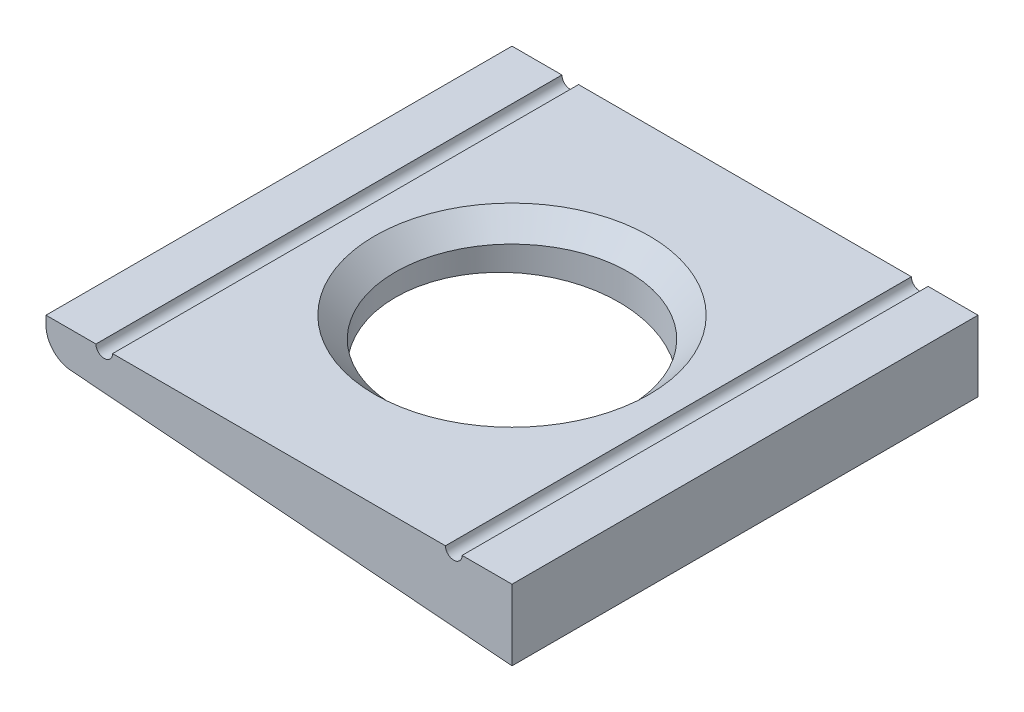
from build123d import *

# Parameters (mm, degrees)
BASE_EXTRUDE_DEPTH = 28
SKETCH2_R          = 14
CUT_EXTRUDE1_DEPTH = 41.5
SKETCH3_R          = 1
ID_GROOVES_DEPTH   = 64.184254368
CHAMFER1_SIZE      = 2.5


with BuildPart() as part:
    # Sketch1 → Base-Extrude (new, symmetric)
    with BuildSketch(Plane.XY):
        with BuildLine():
            Line((28, 0), (-28, 0))
            Line((-28, 0), (-28, -1.065776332))
            ThreePointArc((-28, -1.065776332), (-27.15123277, -3.236422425), (-25.055184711, -4.255585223))
            Line((-25.055184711, -4.255585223), (28, -8.5))
            Line((28, -8.5), (28, 0))
        make_face()
    extrude(amount=BASE_EXTRUDE_DEPTH, both=True)

    # Sketch2 → Cut-Extrude1 (cut, through all)
    with BuildSketch(Plane(origin=(0, 0, 0), x_dir=(-1, 0, 0), z_dir=(0, 1, 0))):
        Circle(SKETCH2_R)
    extrude(amount=-CUT_EXTRUDE1_DEPTH, mode=Mode.SUBTRACT)

    # Sketch3 → ID-Grooves (cut, through all)
    with BuildSketch(Plane.XY.offset(28)):
        with Locations((21, 0)):
            Circle(SKETCH3_R)
        with Locations((-21, 0)):
            Circle(SKETCH3_R)
    extrude(amount=-ID_GROOVES_DEPTH, mode=Mode.SUBTRACT)

    # Chamfer1
    chamfer1_edges = [part.edges().sort_by_distance(p)[0] for p in [
        (14, 0, 0),
    ]]
    chamfer(chamfer1_edges, length=CHAMFER1_SIZE)


solid = part.part
